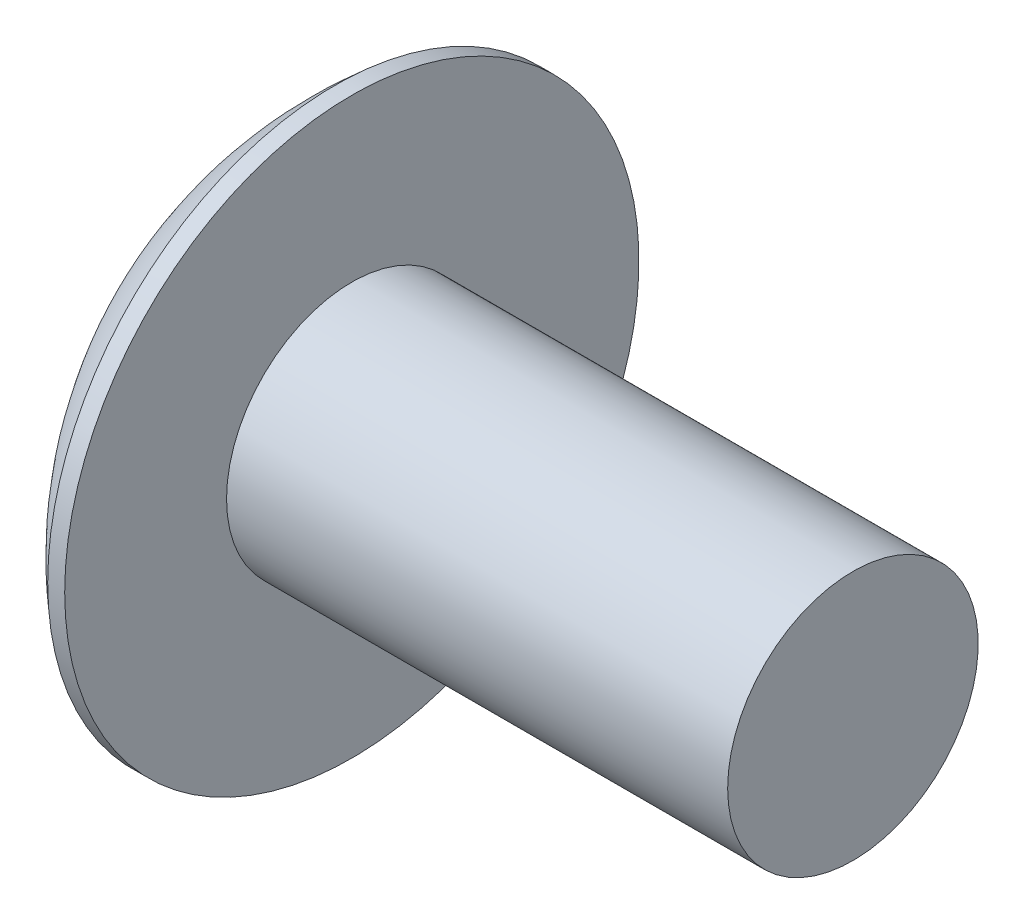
ISO-10303-21;
HEADER;
FILE_DESCRIPTION(('STEP AP214'),'2;1');
FILE_NAME('part.step','',(''),(''),'','','');
FILE_SCHEMA(('AUTOMOTIVE_DESIGN { 1 0 10303 214 1 1 1 1 }'));
ENDSEC;
DATA;
#1=APPLICATION_CONTEXT('core data for automotive mechanical design processes');
#2=APPLICATION_PROTOCOL_DEFINITION('international standard','automotive_design',2000,#1);
#3=PRODUCT_CONTEXT('',#1,'mechanical');
#4=PRODUCT('Part','Part','',(#3));
#5=PRODUCT_RELATED_PRODUCT_CATEGORY('part','',(#4));
#6=PRODUCT_DEFINITION_FORMATION('','',#4);
#7=PRODUCT_DEFINITION_CONTEXT('part definition',#1,'design');
#8=PRODUCT_DEFINITION('design','',#6,#7);
#9=PRODUCT_DEFINITION_SHAPE('','',#8);
#10=(LENGTH_UNIT() NAMED_UNIT(*) SI_UNIT(.MILLI.,.METRE.));
#11=(NAMED_UNIT(*) PLANE_ANGLE_UNIT() SI_UNIT($,.RADIAN.));
#12=(NAMED_UNIT(*) SI_UNIT($,.STERADIAN.) SOLID_ANGLE_UNIT());
#13=UNCERTAINTY_MEASURE_WITH_UNIT(LENGTH_MEASURE(1.E-05),#10,'distance_accuracy_value','');
#14=(GEOMETRIC_REPRESENTATION_CONTEXT(3) GLOBAL_UNCERTAINTY_ASSIGNED_CONTEXT((#13)) GLOBAL_UNIT_ASSIGNED_CONTEXT((#10,
#11,#12)) REPRESENTATION_CONTEXT('',''));
#15=CARTESIAN_POINT('',(0.,0.,0.));
#16=DIRECTION('',(0.,0.,1.));
#17=DIRECTION('',(1.,0.,0.));
#18=AXIS2_PLACEMENT_3D('',#15,#16,#17);
#19=CARTESIAN_POINT('',(9.525,0.,0.));
#20=DIRECTION('',(-1.,0.,0.));
#21=DIRECTION('',(0.,1.,0.));
#22=AXIS2_PLACEMENT_3D('',#19,#20,#21);
#23=SPHERICAL_SURFACE('',#22,9.525);
#24=CARTESIAN_POINT('',(3.37931528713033,0.,0.));
#25=DIRECTION('',(-1.,0.,0.));
#26=DIRECTION('',(0.,0.,1.));
#27=AXIS2_PLACEMENT_3D('',#24,#25,#26);
#28=CIRCLE('',#27,7.2771);
#29=CARTESIAN_POINT('',(3.37931528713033,0.,7.2771));
#30=VERTEX_POINT('',#29);
#31=EDGE_CURVE('E152',#30,#30,#28,.T.);
#32=ORIENTED_EDGE('',*,*,#31,.T.);
#33=EDGE_LOOP('',(#32));
#34=FACE_BOUND('',#33,.T.);
#35=CARTESIAN_POINT('',(9.52329760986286,-0.0217428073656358,0.));
#36=DIRECTION('',(-0.0780578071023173,-0.996948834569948,0.));
#37=DIRECTION('',(0.996948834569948,-0.0780578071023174,0.));
#38=AXIS2_PLACEMENT_3D('',#35,#36,#37);
#39=CIRCLE('',#38,9.5249750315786);
#40=CARTESIAN_POINT('',(0.697961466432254,0.669251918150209,3.51583810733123));
#41=VERTEX_POINT('',#40);
#42=CARTESIAN_POINT('',(0.0545254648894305,0.719630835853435,0.719630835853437));
#43=VERTEX_POINT('',#42);
#44=EDGE_CURVE('E180',#41,#43,#39,.T.);
#45=ORIENTED_EDGE('',*,*,#44,.F.);
#46=CARTESIAN_POINT('',(7.77827630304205,0.,-2.17370060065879));
#47=DIRECTION('',(0.626391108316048,0.,0.779508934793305));
#48=DIRECTION('',(0.779508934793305,0.,-0.626391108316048));
#49=AXIS2_PLACEMENT_3D('',#46,#47,#48);
#50=CIRCLE('',#49,9.10766748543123);
#51=CARTESIAN_POINT('',(0.697961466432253,-0.669251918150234,3.51583810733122));
#52=VERTEX_POINT('',#51);
#53=EDGE_CURVE('E148',#41,#52,#50,.T.);
#54=ORIENTED_EDGE('',*,*,#53,.T.);
#55=CARTESIAN_POINT('',(9.52329760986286,0.0217428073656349,0.));
#56=DIRECTION('',(-0.0780578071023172,0.996948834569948,0.));
#57=DIRECTION('',(-0.996948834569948,-0.0780578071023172,0.));
#58=AXIS2_PLACEMENT_3D('',#55,#56,#57);
#59=CIRCLE('',#58,9.5249750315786);
#60=CARTESIAN_POINT('',(0.0545254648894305,-0.719630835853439,0.719630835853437));
#61=VERTEX_POINT('',#60);
#62=EDGE_CURVE('E104',#61,#52,#59,.T.);
#63=ORIENTED_EDGE('',*,*,#62,.F.);
#64=CARTESIAN_POINT('',(9.52329760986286,0.,-0.0217428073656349));
#65=DIRECTION('',(-0.0780578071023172,0.,-0.996948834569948));
#66=DIRECTION('',(-0.996948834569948,0.,0.0780578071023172));
#67=AXIS2_PLACEMENT_3D('',#64,#65,#66);
#68=CIRCLE('',#67,9.5249750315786);
#69=CARTESIAN_POINT('',(0.697961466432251,-3.51583810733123,0.669251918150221));
#70=VERTEX_POINT('',#69);
#71=EDGE_CURVE('E129',#70,#61,#68,.T.);
#72=ORIENTED_EDGE('',*,*,#71,.F.);
#73=CARTESIAN_POINT('',(7.77827630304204,2.17370060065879,0.));
#74=DIRECTION('',(0.626391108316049,-0.779508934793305,0.));
#75=DIRECTION('',(0.779508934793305,0.626391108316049,0.));
#76=AXIS2_PLACEMENT_3D('',#73,#74,#75);
#77=CIRCLE('',#76,9.10766748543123);
#78=CARTESIAN_POINT('',(0.697961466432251,-3.51583810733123,-0.669251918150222));
#79=VERTEX_POINT('',#78);
#80=EDGE_CURVE('E137',#70,#79,#77,.T.);
#81=ORIENTED_EDGE('',*,*,#80,.T.);
#82=CARTESIAN_POINT('',(9.52329760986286,0.,0.0217428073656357));
#83=DIRECTION('',(-0.0780578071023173,0.,0.996948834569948));
#84=DIRECTION('',(0.996948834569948,0.,0.0780578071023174));
#85=AXIS2_PLACEMENT_3D('',#82,#83,#84);
#86=CIRCLE('',#85,9.5249750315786);
#87=CARTESIAN_POINT('',(0.0545254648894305,-0.719630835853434,-0.719630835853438));
#88=VERTEX_POINT('',#87);
#89=EDGE_CURVE('E47',#88,#79,#86,.T.);
#90=ORIENTED_EDGE('',*,*,#89,.F.);
#91=CARTESIAN_POINT('',(0.697961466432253,-0.669251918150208,-3.51583810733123));
#92=VERTEX_POINT('',#91);
#93=EDGE_CURVE('E187',#92,#88,#59,.T.);
#94=ORIENTED_EDGE('',*,*,#93,.F.);
#95=CARTESIAN_POINT('',(7.77827630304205,0.,2.17370060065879));
#96=DIRECTION('',(0.626391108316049,0.,-0.779508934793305));
#97=DIRECTION('',(-0.779508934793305,0.,-0.626391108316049));
#98=AXIS2_PLACEMENT_3D('',#95,#96,#97);
#99=CIRCLE('',#98,9.10766748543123);
#100=CARTESIAN_POINT('',(0.697961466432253,0.669251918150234,-3.51583810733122));
#101=VERTEX_POINT('',#100);
#102=EDGE_CURVE('E130',#92,#101,#99,.T.);
#103=ORIENTED_EDGE('',*,*,#102,.T.);
#104=CARTESIAN_POINT('',(0.0545254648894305,0.71963083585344,-0.719630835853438));
#105=VERTEX_POINT('',#104);
#106=EDGE_CURVE('E175',#105,#101,#39,.T.);
#107=ORIENTED_EDGE('',*,*,#106,.F.);
#108=CARTESIAN_POINT('',(0.697961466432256,3.51583810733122,-0.669251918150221));
#109=VERTEX_POINT('',#108);
#110=EDGE_CURVE('E40',#109,#105,#86,.T.);
#111=ORIENTED_EDGE('',*,*,#110,.F.);
#112=CARTESIAN_POINT('',(7.77827630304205,-2.17370060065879,0.));
#113=DIRECTION('',(0.626391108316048,0.779508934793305,0.));
#114=DIRECTION('',(-0.779508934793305,0.626391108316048,0.));
#115=AXIS2_PLACEMENT_3D('',#112,#113,#114);
#116=CIRCLE('',#115,9.10766748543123);
#117=CARTESIAN_POINT('',(0.697961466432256,3.51583810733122,0.669251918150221));
#118=VERTEX_POINT('',#117);
#119=EDGE_CURVE('E11',#109,#118,#116,.T.);
#120=ORIENTED_EDGE('',*,*,#119,.T.);
#121=EDGE_CURVE('E163',#43,#118,#68,.T.);
#122=ORIENTED_EDGE('',*,*,#121,.F.);
#123=EDGE_LOOP('',(#45,#54,#63,#72,#81,#90,#94,#103,#107,#111,#120,#122));
#124=FACE_BOUND('',#123,.T.);
#125=ADVANCED_FACE('F32',(#34,#124),#23,.T.);
#126=CARTESIAN_POINT('',(5.07322666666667,0.,-0.326683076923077));
#127=DIRECTION('',(-0.0780578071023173,0.,0.996948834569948));
#128=DIRECTION('',(0.996948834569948,0.,0.0780578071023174));
#129=AXIS2_PLACEMENT_3D('',#126,#127,#128);
#130=PLANE('',#129);
#131=ORIENTED_EDGE('',*,*,#110,.T.);
#132=DIRECTION('',(0.993925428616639,-0.0778210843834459,0.0778210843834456));
#133=VECTOR('',#132,1.);
#134=CARTESIAN_POINT('',(5.09849506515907,0.324704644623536,-0.324704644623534));
#135=LINE('',#134,#133);
#136=CARTESIAN_POINT('',(4.6228,0.361950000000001,-0.361949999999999));
#137=VERTEX_POINT('',#136);
#138=EDGE_CURVE('E169',#105,#137,#135,.T.);
#139=ORIENTED_EDGE('',*,*,#138,.T.);
#140=DIRECTION('',(0.778061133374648,-0.62522769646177,0.0609196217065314));
#141=VECTOR('',#140,1.);
#142=CARTESIAN_POINT('',(0.,4.0767,-0.7239));
#143=LINE('',#142,#141);
#144=EDGE_CURVE('E153',#109,#137,#143,.T.);
#145=ORIENTED_EDGE('',*,*,#144,.F.);
#146=EDGE_LOOP('',(#131,#139,#145));
#147=FACE_BOUND('',#146,.T.);
#148=ADVANCED_FACE('F168',(#147),#130,.T.);
#149=DIRECTION('',(0.778061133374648,0.625227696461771,0.0609196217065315));
#150=VECTOR('',#149,1.);
#151=CARTESIAN_POINT('',(0.,-4.0767,-0.7239));
#152=LINE('',#151,#150);
#153=CARTESIAN_POINT('',(4.6228,-0.36195,-0.36195));
#154=VERTEX_POINT('',#153);
#155=EDGE_CURVE('E138',#79,#154,#152,.T.);
#156=ORIENTED_EDGE('',*,*,#155,.T.);
#157=DIRECTION('',(-0.993925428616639,-0.0778210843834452,-0.0778210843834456));
#158=VECTOR('',#157,1.);
#159=CARTESIAN_POINT('',(5.09849506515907,-0.324704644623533,-0.324704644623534));
#160=LINE('',#159,#158);
#161=EDGE_CURVE('E190',#154,#88,#160,.T.);
#162=ORIENTED_EDGE('',*,*,#161,.T.);
#163=ORIENTED_EDGE('',*,*,#89,.T.);
#164=EDGE_LOOP('',(#156,#162,#163));
#165=FACE_BOUND('',#164,.T.);
#166=ADVANCED_FACE('F205',(#165),#130,.T.);
#167=CARTESIAN_POINT('',(5.07322666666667,0.,0.326683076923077));
#168=DIRECTION('',(-0.0780578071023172,0.,-0.996948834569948));
#169=DIRECTION('',(-0.996948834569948,0.,0.0780578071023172));
#170=AXIS2_PLACEMENT_3D('',#167,#168,#169);
#171=PLANE('',#170);
#172=DIRECTION('',(0.778061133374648,-0.62522769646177,-0.0609196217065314));
#173=VECTOR('',#172,1.);
#174=CARTESIAN_POINT('',(0.,4.0767,0.7239));
#175=LINE('',#174,#173);
#176=CARTESIAN_POINT('',(4.6228,0.36195,0.36195));
#177=VERTEX_POINT('',#176);
#178=EDGE_CURVE('E206',#118,#177,#175,.T.);
#179=ORIENTED_EDGE('',*,*,#178,.T.);
#180=DIRECTION('',(-0.993925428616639,0.0778210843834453,0.0778210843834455));
#181=VECTOR('',#180,1.);
#182=CARTESIAN_POINT('',(5.09849506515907,0.324704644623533,0.324704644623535));
#183=LINE('',#182,#181);
#184=EDGE_CURVE('E184',#177,#43,#183,.T.);
#185=ORIENTED_EDGE('',*,*,#184,.T.);
#186=ORIENTED_EDGE('',*,*,#121,.T.);
#187=EDGE_LOOP('',(#179,#185,#186));
#188=FACE_BOUND('',#187,.T.);
#189=ADVANCED_FACE('F210',(#188),#171,.T.);
#190=ORIENTED_EDGE('',*,*,#71,.T.);
#191=DIRECTION('',(0.993925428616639,0.0778210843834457,-0.0778210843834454));
#192=VECTOR('',#191,1.);
#193=CARTESIAN_POINT('',(5.09849506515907,-0.324704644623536,0.324704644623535));
#194=LINE('',#193,#192);
#195=CARTESIAN_POINT('',(4.6228,-0.361950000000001,0.361949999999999));
#196=VERTEX_POINT('',#195);
#197=EDGE_CURVE('E102',#61,#196,#194,.T.);
#198=ORIENTED_EDGE('',*,*,#197,.T.);
#199=DIRECTION('',(0.778061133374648,0.625227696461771,-0.0609196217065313));
#200=VECTOR('',#199,1.);
#201=CARTESIAN_POINT('',(0.,-4.0767,0.723899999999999));
#202=LINE('',#201,#200);
#203=EDGE_CURVE('E127',#70,#196,#202,.T.);
#204=ORIENTED_EDGE('',*,*,#203,.F.);
#205=EDGE_LOOP('',(#190,#198,#204));
#206=FACE_BOUND('',#205,.T.);
#207=ADVANCED_FACE('F126',(#206),#171,.T.);
#208=CARTESIAN_POINT('',(-25.4,0.,0.));
#209=DIRECTION('',(-1.,0.,0.));
#210=DIRECTION('',(0.,0.,1.));
#211=AXIS2_PLACEMENT_3D('',#208,#209,#210);
#212=CYLINDRICAL_SURFACE('',#211,3.175);
#213=CARTESIAN_POINT('',(16.51,0.,0.));
#214=DIRECTION('',(-1.,0.,0.));
#215=DIRECTION('',(0.,0.,1.));
#216=AXIS2_PLACEMENT_3D('',#213,#214,#215);
#217=CIRCLE('',#216,3.175);
#218=CARTESIAN_POINT('',(16.51,0.,3.175));
#219=VERTEX_POINT('',#218);
#220=EDGE_CURVE('E149',#219,#219,#217,.T.);
#221=ORIENTED_EDGE('',*,*,#220,.T.);
#222=EDGE_LOOP('',(#221));
#223=FACE_BOUND('',#222,.T.);
#224=CARTESIAN_POINT('',(3.81,0.,0.));
#225=DIRECTION('',(-1.,0.,0.));
#226=DIRECTION('',(0.,0.,1.));
#227=AXIS2_PLACEMENT_3D('',#224,#225,#226);
#228=CIRCLE('',#227,3.175);
#229=CARTESIAN_POINT('',(3.81,0.,3.175));
#230=VERTEX_POINT('',#229);
#231=EDGE_CURVE('E159',#230,#230,#228,.T.);
#232=ORIENTED_EDGE('',*,*,#231,.F.);
#233=EDGE_LOOP('',(#232));
#234=FACE_BOUND('',#233,.T.);
#235=ADVANCED_FACE('F34',(#223,#234),#212,.T.);
#236=CARTESIAN_POINT('',(3.81,3.175,0.));
#237=DIRECTION('',(-1.,0.,0.));
#238=DIRECTION('',(0.,0.,1.));
#239=AXIS2_PLACEMENT_3D('',#236,#237,#238);
#240=PLANE('',#239);
#241=CARTESIAN_POINT('',(3.81,0.,0.));
#242=DIRECTION('',(-1.,0.,0.));
#243=DIRECTION('',(0.,0.,1.));
#244=AXIS2_PLACEMENT_3D('',#241,#242,#243);
#245=CIRCLE('',#244,7.2771);
#246=CARTESIAN_POINT('',(3.81,0.,7.2771));
#247=VERTEX_POINT('',#246);
#248=EDGE_CURVE('E156',#247,#247,#245,.T.);
#249=ORIENTED_EDGE('',*,*,#248,.F.);
#250=EDGE_LOOP('',(#249));
#251=FACE_BOUND('',#250,.T.);
#252=ORIENTED_EDGE('',*,*,#231,.T.);
#253=EDGE_LOOP('',(#252));
#254=FACE_BOUND('',#253,.T.);
#255=ADVANCED_FACE('F234',(#251,#254),#240,.F.);
#256=CARTESIAN_POINT('',(-25.4,0.,0.));
#257=DIRECTION('',(-1.,0.,0.));
#258=DIRECTION('',(0.,0.,1.));
#259=AXIS2_PLACEMENT_3D('',#256,#257,#258);
#260=CYLINDRICAL_SURFACE('',#259,7.2771);
#261=ORIENTED_EDGE('',*,*,#248,.T.);
#262=EDGE_LOOP('',(#261));
#263=FACE_BOUND('',#262,.T.);
#264=ORIENTED_EDGE('',*,*,#31,.F.);
#265=EDGE_LOOP('',(#264));
#266=FACE_BOUND('',#265,.T.);
#267=ADVANCED_FACE('F232',(#263,#266),#260,.T.);
#268=CARTESIAN_POINT('',(16.51,3.175,0.));
#269=DIRECTION('',(1.,0.,0.));
#270=DIRECTION('',(0.,0.,-1.));
#271=AXIS2_PLACEMENT_3D('',#268,#269,#270);
#272=PLANE('',#271);
#273=ORIENTED_EDGE('',*,*,#220,.F.);
#274=EDGE_LOOP('',(#273));
#275=FACE_BOUND('',#274,.T.);
#276=ADVANCED_FACE('F230',(#275),#272,.T.);
#277=CARTESIAN_POINT('',(4.6228,0.36195,0.36195));
#278=DIRECTION('',(0.626391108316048,0.779508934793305,0.));
#279=DIRECTION('',(-0.779508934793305,0.626391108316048,0.));
#280=AXIS2_PLACEMENT_3D('',#277,#278,#279);
#281=PLANE('',#280);
#282=ORIENTED_EDGE('',*,*,#144,.T.);
#283=DIRECTION('',(0.,0.,-1.));
#284=VECTOR('',#283,1.);
#285=CARTESIAN_POINT('',(4.6228,0.36195,0.36195));
#286=LINE('',#285,#284);
#287=EDGE_CURVE('E120',#177,#137,#286,.T.);
#288=ORIENTED_EDGE('',*,*,#287,.F.);
#289=ORIENTED_EDGE('',*,*,#178,.F.);
#290=ORIENTED_EDGE('',*,*,#119,.F.);
#291=EDGE_LOOP('',(#282,#288,#289,#290));
#292=FACE_BOUND('',#291,.T.);
#293=ADVANCED_FACE('F209',(#292),#281,.F.);
#294=CARTESIAN_POINT('',(4.6228,-0.36195,-0.36195));
#295=DIRECTION('',(0.626391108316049,-0.779508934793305,0.));
#296=DIRECTION('',(0.779508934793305,0.626391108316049,0.));
#297=AXIS2_PLACEMENT_3D('',#294,#295,#296);
#298=PLANE('',#297);
#299=ORIENTED_EDGE('',*,*,#203,.T.);
#300=DIRECTION('',(0.,0.,1.));
#301=VECTOR('',#300,1.);
#302=CARTESIAN_POINT('',(4.6228,-0.36195,-0.36195));
#303=LINE('',#302,#301);
#304=EDGE_CURVE('E119',#154,#196,#303,.T.);
#305=ORIENTED_EDGE('',*,*,#304,.F.);
#306=ORIENTED_EDGE('',*,*,#155,.F.);
#307=ORIENTED_EDGE('',*,*,#80,.F.);
#308=EDGE_LOOP('',(#299,#305,#306,#307));
#309=FACE_BOUND('',#308,.T.);
#310=ADVANCED_FACE('F134',(#309),#298,.F.);
#311=CARTESIAN_POINT('',(4.6228,0.36195,-0.36195));
#312=DIRECTION('',(-1.,0.,0.));
#313=DIRECTION('',(0.,0.,1.));
#314=AXIS2_PLACEMENT_3D('',#311,#312,#313);
#315=PLANE('',#314);
#316=DIRECTION('',(0.,1.,0.));
#317=VECTOR('',#316,1.);
#318=CARTESIAN_POINT('',(4.6228,-0.36195,-0.36195));
#319=LINE('',#318,#317);
#320=EDGE_CURVE('E142',#154,#137,#319,.T.);
#321=ORIENTED_EDGE('',*,*,#320,.F.);
#322=ORIENTED_EDGE('',*,*,#304,.T.);
#323=DIRECTION('',(0.,-1.,0.));
#324=VECTOR('',#323,1.);
#325=CARTESIAN_POINT('',(4.6228,0.36195,0.36195));
#326=LINE('',#325,#324);
#327=EDGE_CURVE('E111',#177,#196,#326,.T.);
#328=ORIENTED_EDGE('',*,*,#327,.F.);
#329=ORIENTED_EDGE('',*,*,#287,.T.);
#330=EDGE_LOOP('',(#321,#322,#328,#329));
#331=FACE_BOUND('',#330,.T.);
#332=ADVANCED_FACE('F140',(#331),#315,.T.);
#333=CARTESIAN_POINT('',(4.6228,0.361950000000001,-0.361949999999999));
#334=DIRECTION('',(0.626391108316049,0.,-0.779508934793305));
#335=DIRECTION('',(0.779508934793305,0.,0.626391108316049));
#336=AXIS2_PLACEMENT_3D('',#333,#334,#335);
#337=PLANE('',#336);
#338=DIRECTION('',(0.778061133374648,0.0609196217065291,0.625227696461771));
#339=VECTOR('',#338,1.);
#340=CARTESIAN_POINT('',(0.,-0.723899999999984,-4.0767));
#341=LINE('',#340,#339);
#342=EDGE_CURVE('E195',#92,#154,#341,.T.);
#343=ORIENTED_EDGE('',*,*,#342,.T.);
#344=ORIENTED_EDGE('',*,*,#320,.T.);
#345=DIRECTION('',(0.778061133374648,-0.0609196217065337,0.62522769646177));
#346=VECTOR('',#345,1.);
#347=CARTESIAN_POINT('',(0.,0.723900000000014,-4.0767));
#348=LINE('',#347,#346);
#349=EDGE_CURVE('E108',#101,#137,#348,.T.);
#350=ORIENTED_EDGE('',*,*,#349,.F.);
#351=ORIENTED_EDGE('',*,*,#102,.F.);
#352=EDGE_LOOP('',(#343,#344,#350,#351));
#353=FACE_BOUND('',#352,.T.);
#354=ADVANCED_FACE('F200',(#353),#337,.F.);
#355=CARTESIAN_POINT('',(5.07322666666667,-0.326683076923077,0.));
#356=DIRECTION('',(-0.0780578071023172,0.996948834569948,0.));
#357=DIRECTION('',(-0.996948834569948,-0.0780578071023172,0.));
#358=AXIS2_PLACEMENT_3D('',#355,#356,#357);
#359=PLANE('',#358);
#360=ORIENTED_EDGE('',*,*,#93,.T.);
#361=ORIENTED_EDGE('',*,*,#161,.F.);
#362=ORIENTED_EDGE('',*,*,#342,.F.);
#363=EDGE_LOOP('',(#360,#361,#362));
#364=FACE_BOUND('',#363,.T.);
#365=ADVANCED_FACE('F204',(#364),#359,.T.);
#366=CARTESIAN_POINT('',(5.07322666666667,0.326683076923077,0.));
#367=DIRECTION('',(-0.0780578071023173,-0.996948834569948,0.));
#368=DIRECTION('',(0.996948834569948,-0.0780578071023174,0.));
#369=AXIS2_PLACEMENT_3D('',#366,#367,#368);
#370=PLANE('',#369);
#371=ORIENTED_EDGE('',*,*,#106,.T.);
#372=ORIENTED_EDGE('',*,*,#349,.T.);
#373=ORIENTED_EDGE('',*,*,#138,.F.);
#374=EDGE_LOOP('',(#371,#372,#373));
#375=FACE_BOUND('',#374,.T.);
#376=ADVANCED_FACE('F198',(#375),#370,.T.);
#377=CARTESIAN_POINT('',(4.6228,-0.361950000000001,0.361949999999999));
#378=DIRECTION('',(0.626391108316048,0.,0.779508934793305));
#379=DIRECTION('',(-0.779508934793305,0.,0.626391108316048));
#380=AXIS2_PLACEMENT_3D('',#377,#378,#379);
#381=PLANE('',#380);
#382=DIRECTION('',(0.778061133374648,-0.0609196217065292,-0.625227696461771));
#383=VECTOR('',#382,1.);
#384=CARTESIAN_POINT('',(0.,0.723899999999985,4.0767));
#385=LINE('',#384,#383);
#386=EDGE_CURVE('E107',#41,#177,#385,.T.);
#387=ORIENTED_EDGE('',*,*,#386,.T.);
#388=ORIENTED_EDGE('',*,*,#327,.T.);
#389=DIRECTION('',(0.778061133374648,0.0609196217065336,-0.62522769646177));
#390=VECTOR('',#389,1.);
#391=CARTESIAN_POINT('',(0.,-0.723900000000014,4.0767));
#392=LINE('',#391,#390);
#393=EDGE_CURVE('E98',#52,#196,#392,.T.);
#394=ORIENTED_EDGE('',*,*,#393,.F.);
#395=ORIENTED_EDGE('',*,*,#53,.F.);
#396=EDGE_LOOP('',(#387,#388,#394,#395));
#397=FACE_BOUND('',#396,.T.);
#398=ADVANCED_FACE('F112',(#397),#381,.F.);
#399=ORIENTED_EDGE('',*,*,#44,.T.);
#400=ORIENTED_EDGE('',*,*,#184,.F.);
#401=ORIENTED_EDGE('',*,*,#386,.F.);
#402=EDGE_LOOP('',(#399,#400,#401));
#403=FACE_BOUND('',#402,.T.);
#404=ADVANCED_FACE('F211',(#403),#370,.T.);
#405=ORIENTED_EDGE('',*,*,#62,.T.);
#406=ORIENTED_EDGE('',*,*,#393,.T.);
#407=ORIENTED_EDGE('',*,*,#197,.F.);
#408=EDGE_LOOP('',(#405,#406,#407));
#409=FACE_BOUND('',#408,.T.);
#410=ADVANCED_FACE('F100',(#409),#359,.T.);
#411=CLOSED_SHELL('',(#125,#148,#166,#189,#207,#235,#255,#267,#276,#293,#310,#332,#354,#365,
#376,#398,#404,#410));
#412=MANIFOLD_SOLID_BREP('B2',#411);
#413=ADVANCED_BREP_SHAPE_REPRESENTATION('',(#18,#412),#14);
#414=SHAPE_DEFINITION_REPRESENTATION(#9,#413);
ENDSEC;
END-ISO-10303-21;
